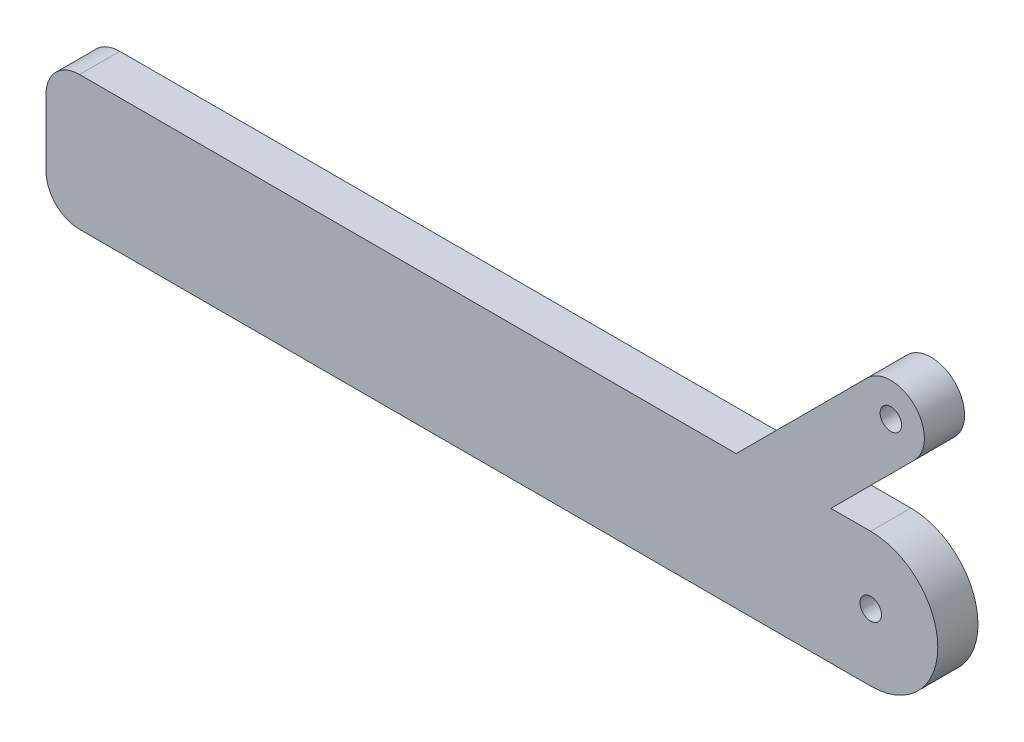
ISO-10303-21;
HEADER;
FILE_DESCRIPTION(('STEP AP214'),'2;1');
FILE_NAME('part.step','',(''),(''),'','','');
FILE_SCHEMA(('AUTOMOTIVE_DESIGN { 1 0 10303 214 1 1 1 1 }'));
ENDSEC;
DATA;
#1=APPLICATION_CONTEXT('core data for automotive mechanical design processes');
#2=APPLICATION_PROTOCOL_DEFINITION('international standard','automotive_design',2000,#1);
#3=PRODUCT_CONTEXT('',#1,'mechanical');
#4=PRODUCT('Part','Part','',(#3));
#5=PRODUCT_RELATED_PRODUCT_CATEGORY('part','',(#4));
#6=PRODUCT_DEFINITION_FORMATION('','',#4);
#7=PRODUCT_DEFINITION_CONTEXT('part definition',#1,'design');
#8=PRODUCT_DEFINITION('design','',#6,#7);
#9=PRODUCT_DEFINITION_SHAPE('','',#8);
#10=(LENGTH_UNIT() NAMED_UNIT(*) SI_UNIT(.MILLI.,.METRE.));
#11=(NAMED_UNIT(*) PLANE_ANGLE_UNIT() SI_UNIT($,.RADIAN.));
#12=(NAMED_UNIT(*) SI_UNIT($,.STERADIAN.) SOLID_ANGLE_UNIT());
#13=UNCERTAINTY_MEASURE_WITH_UNIT(LENGTH_MEASURE(1.E-05),#10,'distance_accuracy_value','');
#14=(GEOMETRIC_REPRESENTATION_CONTEXT(3) GLOBAL_UNCERTAINTY_ASSIGNED_CONTEXT((#13)) GLOBAL_UNIT_ASSIGNED_CONTEXT((#10,
#11,#12)) REPRESENTATION_CONTEXT('',''));
#15=CARTESIAN_POINT('',(0.,0.,0.));
#16=DIRECTION('',(0.,0.,1.));
#17=DIRECTION('',(1.,0.,0.));
#18=AXIS2_PLACEMENT_3D('',#15,#16,#17);
#19=CARTESIAN_POINT('',(-95.,-5.00000000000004,6.));
#20=DIRECTION('',(0.,0.,1.));
#21=DIRECTION('',(1.,0.,0.));
#22=AXIS2_PLACEMENT_3D('',#19,#20,#21);
#23=PLANE('',#22);
#24=CARTESIAN_POINT('',(23.,0.,6.));
#25=DIRECTION('',(0.,0.,1.));
#26=DIRECTION('',(1.,0.,0.));
#27=AXIS2_PLACEMENT_3D('',#24,#25,#26);
#28=CIRCLE('',#27,1.6);
#29=CARTESIAN_POINT('',(24.6,0.,6.));
#30=VERTEX_POINT('',#29);
#31=EDGE_CURVE('E150',#30,#30,#28,.T.);
#32=ORIENTED_EDGE('',*,*,#31,.F.);
#33=EDGE_LOOP('',(#32));
#34=FACE_BOUND('',#33,.T.);
#35=CARTESIAN_POINT('',(-95.,-5.00000000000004,6.));
#36=DIRECTION('',(0.,0.,1.));
#37=DIRECTION('',(1.,0.,0.));
#38=AXIS2_PLACEMENT_3D('',#35,#36,#37);
#39=CIRCLE('',#38,5.);
#40=CARTESIAN_POINT('',(-100.,-5.00000000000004,6.));
#41=VERTEX_POINT('',#40);
#42=CARTESIAN_POINT('',(-95.,-10.,6.));
#43=VERTEX_POINT('',#42);
#44=EDGE_CURVE('E165',#41,#43,#39,.T.);
#45=ORIENTED_EDGE('',*,*,#44,.T.);
#46=DIRECTION('',(1.,0.,0.));
#47=VECTOR('',#46,1.);
#48=CARTESIAN_POINT('',(-95.,-10.,6.));
#49=LINE('',#48,#47);
#50=CARTESIAN_POINT('',(23.,-9.99999999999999,6.));
#51=VERTEX_POINT('',#50);
#52=EDGE_CURVE('E103',#43,#51,#49,.T.);
#53=ORIENTED_EDGE('',*,*,#52,.T.);
#54=CARTESIAN_POINT('',(23.,0.,6.));
#55=DIRECTION('',(0.,0.,1.));
#56=DIRECTION('',(1.,0.,0.));
#57=AXIS2_PLACEMENT_3D('',#54,#55,#56);
#58=CIRCLE('',#57,9.99999999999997);
#59=CARTESIAN_POINT('',(23.,9.99999999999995,6.));
#60=VERTEX_POINT('',#59);
#61=EDGE_CURVE('E186',#51,#60,#58,.T.);
#62=ORIENTED_EDGE('',*,*,#61,.T.);
#63=DIRECTION('',(-1.,0.,0.));
#64=VECTOR('',#63,1.);
#65=CARTESIAN_POINT('',(23.,9.99999999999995,6.));
#66=LINE('',#65,#64);
#67=CARTESIAN_POINT('',(17.0710678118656,9.99999999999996,6.));
#68=VERTEX_POINT('',#67);
#69=EDGE_CURVE('E205',#60,#68,#66,.T.);
#70=ORIENTED_EDGE('',*,*,#69,.T.);
#71=DIRECTION('',(0.707106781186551,0.707106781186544,0.));
#72=VECTOR('',#71,1.);
#73=CARTESIAN_POINT('',(29.535533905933,22.4644660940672,6.));
#74=LINE('',#73,#72);
#75=CARTESIAN_POINT('',(29.535533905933,22.4644660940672,6.));
#76=VERTEX_POINT('',#75);
#77=EDGE_CURVE('E202',#68,#76,#74,.T.);
#78=ORIENTED_EDGE('',*,*,#77,.T.);
#79=CARTESIAN_POINT('',(26.0000000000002,26.,6.));
#80=DIRECTION('',(0.,0.,1.));
#81=DIRECTION('',(1.,0.,0.));
#82=AXIS2_PLACEMENT_3D('',#79,#80,#81);
#83=CIRCLE('',#82,5.);
#84=CARTESIAN_POINT('',(22.4644660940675,29.5355339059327,6.));
#85=VERTEX_POINT('',#84);
#86=EDGE_CURVE('E204',#76,#85,#83,.T.);
#87=ORIENTED_EDGE('',*,*,#86,.T.);
#88=DIRECTION('',(-0.707106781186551,-0.707106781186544,0.));
#89=VECTOR('',#88,1.);
#90=CARTESIAN_POINT('',(22.4644660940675,29.5355339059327,6.));
#91=LINE('',#90,#89);
#92=CARTESIAN_POINT('',(2.92893218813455,9.99999999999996,6.));
#93=VERTEX_POINT('',#92);
#94=EDGE_CURVE('E128',#85,#93,#91,.T.);
#95=ORIENTED_EDGE('',*,*,#94,.T.);
#96=DIRECTION('',(-1.,0.,0.));
#97=VECTOR('',#96,1.);
#98=CARTESIAN_POINT('',(2.92893218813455,9.99999999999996,6.));
#99=LINE('',#98,#97);
#100=CARTESIAN_POINT('',(-95.,9.99999999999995,6.));
#101=VERTEX_POINT('',#100);
#102=EDGE_CURVE('E122',#93,#101,#99,.T.);
#103=ORIENTED_EDGE('',*,*,#102,.T.);
#104=CARTESIAN_POINT('',(-95.,4.99999999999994,6.));
#105=DIRECTION('',(0.,0.,1.));
#106=DIRECTION('',(1.,0.,0.));
#107=AXIS2_PLACEMENT_3D('',#104,#105,#106);
#108=CIRCLE('',#107,5.);
#109=CARTESIAN_POINT('',(-100.,4.99999999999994,6.));
#110=VERTEX_POINT('',#109);
#111=EDGE_CURVE('E126',#101,#110,#108,.T.);
#112=ORIENTED_EDGE('',*,*,#111,.T.);
#113=DIRECTION('',(0.,-1.,0.));
#114=VECTOR('',#113,1.);
#115=CARTESIAN_POINT('',(-100.,4.99999999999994,6.));
#116=LINE('',#115,#114);
#117=EDGE_CURVE('E54',#110,#41,#116,.T.);
#118=ORIENTED_EDGE('',*,*,#117,.T.);
#119=EDGE_LOOP('',(#45,#53,#62,#70,#78,#87,#95,#103,#112,#118));
#120=FACE_BOUND('',#119,.T.);
#121=CARTESIAN_POINT('',(26.0000000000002,26.,6.));
#122=DIRECTION('',(0.,0.,1.));
#123=DIRECTION('',(1.,0.,0.));
#124=AXIS2_PLACEMENT_3D('',#121,#122,#123);
#125=CIRCLE('',#124,1.6);
#126=CARTESIAN_POINT('',(27.6000000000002,26.,6.));
#127=VERTEX_POINT('',#126);
#128=EDGE_CURVE('E216',#127,#127,#125,.T.);
#129=ORIENTED_EDGE('',*,*,#128,.F.);
#130=EDGE_LOOP('',(#129));
#131=FACE_BOUND('',#130,.T.);
#132=ADVANCED_FACE('F37',(#34,#120,#131),#23,.T.);
#133=CARTESIAN_POINT('',(-95.,-5.00000000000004,0.));
#134=DIRECTION('',(0.,0.,1.));
#135=DIRECTION('',(1.,0.,0.));
#136=AXIS2_PLACEMENT_3D('',#133,#134,#135);
#137=PLANE('',#136);
#138=CARTESIAN_POINT('',(23.,0.,0.));
#139=DIRECTION('',(0.,0.,1.));
#140=DIRECTION('',(1.,0.,0.));
#141=AXIS2_PLACEMENT_3D('',#138,#139,#140);
#142=CIRCLE('',#141,1.6);
#143=CARTESIAN_POINT('',(24.6,0.,0.));
#144=VERTEX_POINT('',#143);
#145=EDGE_CURVE('E213',#144,#144,#142,.T.);
#146=ORIENTED_EDGE('',*,*,#145,.T.);
#147=EDGE_LOOP('',(#146));
#148=FACE_BOUND('',#147,.T.);
#149=CARTESIAN_POINT('',(-95.,-5.00000000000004,0.));
#150=DIRECTION('',(0.,0.,1.));
#151=DIRECTION('',(1.,0.,0.));
#152=AXIS2_PLACEMENT_3D('',#149,#150,#151);
#153=CIRCLE('',#152,5.);
#154=CARTESIAN_POINT('',(-100.,-5.00000000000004,0.));
#155=VERTEX_POINT('',#154);
#156=CARTESIAN_POINT('',(-95.,-10.,0.));
#157=VERTEX_POINT('',#156);
#158=EDGE_CURVE('E146',#155,#157,#153,.T.);
#159=ORIENTED_EDGE('',*,*,#158,.F.);
#160=DIRECTION('',(0.,-1.,0.));
#161=VECTOR('',#160,1.);
#162=CARTESIAN_POINT('',(-100.,4.99999999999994,0.));
#163=LINE('',#162,#161);
#164=CARTESIAN_POINT('',(-100.,4.99999999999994,0.));
#165=VERTEX_POINT('',#164);
#166=EDGE_CURVE('E95',#165,#155,#163,.T.);
#167=ORIENTED_EDGE('',*,*,#166,.F.);
#168=CARTESIAN_POINT('',(-95.,4.99999999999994,0.));
#169=DIRECTION('',(0.,0.,1.));
#170=DIRECTION('',(1.,0.,0.));
#171=AXIS2_PLACEMENT_3D('',#168,#169,#170);
#172=CIRCLE('',#171,5.);
#173=CARTESIAN_POINT('',(-95.,9.99999999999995,0.));
#174=VERTEX_POINT('',#173);
#175=EDGE_CURVE('E89',#174,#165,#172,.T.);
#176=ORIENTED_EDGE('',*,*,#175,.F.);
#177=DIRECTION('',(-1.,0.,0.));
#178=VECTOR('',#177,1.);
#179=CARTESIAN_POINT('',(2.92893218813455,9.99999999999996,0.));
#180=LINE('',#179,#178);
#181=CARTESIAN_POINT('',(2.92893218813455,9.99999999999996,0.));
#182=VERTEX_POINT('',#181);
#183=EDGE_CURVE('E136',#182,#174,#180,.T.);
#184=ORIENTED_EDGE('',*,*,#183,.F.);
#185=DIRECTION('',(-0.707106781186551,-0.707106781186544,0.));
#186=VECTOR('',#185,1.);
#187=CARTESIAN_POINT('',(22.4644660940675,29.5355339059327,0.));
#188=LINE('',#187,#186);
#189=CARTESIAN_POINT('',(22.4644660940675,29.5355339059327,0.));
#190=VERTEX_POINT('',#189);
#191=EDGE_CURVE('E160',#190,#182,#188,.T.);
#192=ORIENTED_EDGE('',*,*,#191,.F.);
#193=CARTESIAN_POINT('',(26.0000000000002,26.,0.));
#194=DIRECTION('',(0.,0.,1.));
#195=DIRECTION('',(1.,0.,0.));
#196=AXIS2_PLACEMENT_3D('',#193,#194,#195);
#197=CIRCLE('',#196,5.);
#198=CARTESIAN_POINT('',(29.535533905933,22.4644660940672,0.));
#199=VERTEX_POINT('',#198);
#200=EDGE_CURVE('E158',#199,#190,#197,.T.);
#201=ORIENTED_EDGE('',*,*,#200,.F.);
#202=DIRECTION('',(0.707106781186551,0.707106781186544,0.));
#203=VECTOR('',#202,1.);
#204=CARTESIAN_POINT('',(29.535533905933,22.4644660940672,0.));
#205=LINE('',#204,#203);
#206=CARTESIAN_POINT('',(17.0710678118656,9.99999999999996,0.));
#207=VERTEX_POINT('',#206);
#208=EDGE_CURVE('E156',#207,#199,#205,.T.);
#209=ORIENTED_EDGE('',*,*,#208,.F.);
#210=DIRECTION('',(-1.,0.,0.));
#211=VECTOR('',#210,1.);
#212=CARTESIAN_POINT('',(23.,9.99999999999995,0.));
#213=LINE('',#212,#211);
#214=CARTESIAN_POINT('',(23.,9.99999999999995,0.));
#215=VERTEX_POINT('',#214);
#216=EDGE_CURVE('E154',#215,#207,#213,.T.);
#217=ORIENTED_EDGE('',*,*,#216,.F.);
#218=CARTESIAN_POINT('',(23.,0.,0.));
#219=DIRECTION('',(0.,0.,1.));
#220=DIRECTION('',(1.,0.,0.));
#221=AXIS2_PLACEMENT_3D('',#218,#219,#220);
#222=CIRCLE('',#221,9.99999999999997);
#223=CARTESIAN_POINT('',(23.,-9.99999999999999,0.));
#224=VERTEX_POINT('',#223);
#225=EDGE_CURVE('E152',#224,#215,#222,.T.);
#226=ORIENTED_EDGE('',*,*,#225,.F.);
#227=DIRECTION('',(1.,0.,0.));
#228=VECTOR('',#227,1.);
#229=CARTESIAN_POINT('',(-95.,-10.,0.));
#230=LINE('',#229,#228);
#231=EDGE_CURVE('E149',#157,#224,#230,.T.);
#232=ORIENTED_EDGE('',*,*,#231,.F.);
#233=EDGE_LOOP('',(#159,#167,#176,#184,#192,#201,#209,#217,#226,#232));
#234=FACE_BOUND('',#233,.T.);
#235=CARTESIAN_POINT('',(26.0000000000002,26.,0.));
#236=DIRECTION('',(0.,0.,1.));
#237=DIRECTION('',(1.,0.,0.));
#238=AXIS2_PLACEMENT_3D('',#235,#236,#237);
#239=CIRCLE('',#238,1.6);
#240=CARTESIAN_POINT('',(27.6000000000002,26.,0.));
#241=VERTEX_POINT('',#240);
#242=EDGE_CURVE('E219',#241,#241,#239,.T.);
#243=ORIENTED_EDGE('',*,*,#242,.T.);
#244=EDGE_LOOP('',(#243));
#245=FACE_BOUND('',#244,.T.);
#246=ADVANCED_FACE('F190',(#148,#234,#245),#137,.F.);
#247=CARTESIAN_POINT('',(-95.,-5.00000000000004,6.));
#248=DIRECTION('',(0.,0.,-1.));
#249=DIRECTION('',(-1.,0.,0.));
#250=AXIS2_PLACEMENT_3D('',#247,#248,#249);
#251=CYLINDRICAL_SURFACE('',#250,5.);
#252=ORIENTED_EDGE('',*,*,#158,.T.);
#253=DIRECTION('',(0.,0.,-1.));
#254=VECTOR('',#253,1.);
#255=CARTESIAN_POINT('',(-95.,-10.,6.));
#256=LINE('',#255,#254);
#257=EDGE_CURVE('E11',#43,#157,#256,.T.);
#258=ORIENTED_EDGE('',*,*,#257,.F.);
#259=ORIENTED_EDGE('',*,*,#44,.F.);
#260=DIRECTION('',(0.,0.,-1.));
#261=VECTOR('',#260,1.);
#262=CARTESIAN_POINT('',(-100.,-5.00000000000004,6.));
#263=LINE('',#262,#261);
#264=EDGE_CURVE('E142',#41,#155,#263,.T.);
#265=ORIENTED_EDGE('',*,*,#264,.T.);
#266=EDGE_LOOP('',(#252,#258,#259,#265));
#267=FACE_BOUND('',#266,.T.);
#268=ADVANCED_FACE('F39',(#267),#251,.T.);
#269=CARTESIAN_POINT('',(-95.,-10.,6.));
#270=DIRECTION('',(0.,1.,0.));
#271=DIRECTION('',(-1.,0.,0.));
#272=AXIS2_PLACEMENT_3D('',#269,#270,#271);
#273=PLANE('',#272);
#274=ORIENTED_EDGE('',*,*,#231,.T.);
#275=DIRECTION('',(0.,0.,-1.));
#276=VECTOR('',#275,1.);
#277=CARTESIAN_POINT('',(23.,-9.99999999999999,6.));
#278=LINE('',#277,#276);
#279=EDGE_CURVE('E46',#51,#224,#278,.T.);
#280=ORIENTED_EDGE('',*,*,#279,.F.);
#281=ORIENTED_EDGE('',*,*,#52,.F.);
#282=ORIENTED_EDGE('',*,*,#257,.T.);
#283=EDGE_LOOP('',(#274,#280,#281,#282));
#284=FACE_BOUND('',#283,.T.);
#285=ADVANCED_FACE('F260',(#284),#273,.F.);
#286=CARTESIAN_POINT('',(23.,0.,6.));
#287=DIRECTION('',(0.,0.,-1.));
#288=DIRECTION('',(-1.,0.,0.));
#289=AXIS2_PLACEMENT_3D('',#286,#287,#288);
#290=CYLINDRICAL_SURFACE('',#289,9.99999999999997);
#291=ORIENTED_EDGE('',*,*,#225,.T.);
#292=DIRECTION('',(0.,0.,-1.));
#293=VECTOR('',#292,1.);
#294=CARTESIAN_POINT('',(23.,9.99999999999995,6.));
#295=LINE('',#294,#293);
#296=EDGE_CURVE('E178',#60,#215,#295,.T.);
#297=ORIENTED_EDGE('',*,*,#296,.F.);
#298=ORIENTED_EDGE('',*,*,#61,.F.);
#299=ORIENTED_EDGE('',*,*,#279,.T.);
#300=EDGE_LOOP('',(#291,#297,#298,#299));
#301=FACE_BOUND('',#300,.T.);
#302=ADVANCED_FACE('F184',(#301),#290,.T.);
#303=CARTESIAN_POINT('',(23.,9.99999999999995,6.));
#304=DIRECTION('',(0.,-1.,0.));
#305=DIRECTION('',(1.,0.,0.));
#306=AXIS2_PLACEMENT_3D('',#303,#304,#305);
#307=PLANE('',#306);
#308=ORIENTED_EDGE('',*,*,#216,.T.);
#309=DIRECTION('',(0.,0.,-1.));
#310=VECTOR('',#309,1.);
#311=CARTESIAN_POINT('',(17.0710678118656,9.99999999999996,6.));
#312=LINE('',#311,#310);
#313=EDGE_CURVE('E175',#68,#207,#312,.T.);
#314=ORIENTED_EDGE('',*,*,#313,.F.);
#315=ORIENTED_EDGE('',*,*,#69,.F.);
#316=ORIENTED_EDGE('',*,*,#296,.T.);
#317=EDGE_LOOP('',(#308,#314,#315,#316));
#318=FACE_BOUND('',#317,.T.);
#319=ADVANCED_FACE('F196',(#318),#307,.F.);
#320=CARTESIAN_POINT('',(29.535533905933,22.4644660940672,6.));
#321=DIRECTION('',(-0.707106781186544,0.707106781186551,0.));
#322=DIRECTION('',(-0.707106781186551,-0.707106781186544,0.));
#323=AXIS2_PLACEMENT_3D('',#320,#321,#322);
#324=PLANE('',#323);
#325=ORIENTED_EDGE('',*,*,#208,.T.);
#326=DIRECTION('',(0.,0.,-1.));
#327=VECTOR('',#326,1.);
#328=CARTESIAN_POINT('',(29.535533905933,22.4644660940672,6.));
#329=LINE('',#328,#327);
#330=EDGE_CURVE('E172',#76,#199,#329,.T.);
#331=ORIENTED_EDGE('',*,*,#330,.F.);
#332=ORIENTED_EDGE('',*,*,#77,.F.);
#333=ORIENTED_EDGE('',*,*,#313,.T.);
#334=EDGE_LOOP('',(#325,#331,#332,#333));
#335=FACE_BOUND('',#334,.T.);
#336=ADVANCED_FACE('F200',(#335),#324,.F.);
#337=CARTESIAN_POINT('',(26.0000000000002,26.,6.));
#338=DIRECTION('',(0.,0.,-1.));
#339=DIRECTION('',(-1.,0.,0.));
#340=AXIS2_PLACEMENT_3D('',#337,#338,#339);
#341=CYLINDRICAL_SURFACE('',#340,5.);
#342=ORIENTED_EDGE('',*,*,#200,.T.);
#343=DIRECTION('',(0.,0.,-1.));
#344=VECTOR('',#343,1.);
#345=CARTESIAN_POINT('',(22.4644660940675,29.5355339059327,6.));
#346=LINE('',#345,#344);
#347=EDGE_CURVE('E169',#85,#190,#346,.T.);
#348=ORIENTED_EDGE('',*,*,#347,.F.);
#349=ORIENTED_EDGE('',*,*,#86,.F.);
#350=ORIENTED_EDGE('',*,*,#330,.T.);
#351=EDGE_LOOP('',(#342,#348,#349,#350));
#352=FACE_BOUND('',#351,.T.);
#353=ADVANCED_FACE('F250',(#352),#341,.T.);
#354=CARTESIAN_POINT('',(22.4644660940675,29.5355339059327,6.));
#355=DIRECTION('',(0.707106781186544,-0.707106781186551,0.));
#356=DIRECTION('',(0.707106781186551,0.707106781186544,0.));
#357=AXIS2_PLACEMENT_3D('',#354,#355,#356);
#358=PLANE('',#357);
#359=ORIENTED_EDGE('',*,*,#191,.T.);
#360=DIRECTION('',(0.,0.,-1.));
#361=VECTOR('',#360,1.);
#362=CARTESIAN_POINT('',(2.92893218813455,9.99999999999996,6.));
#363=LINE('',#362,#361);
#364=EDGE_CURVE('E137',#93,#182,#363,.T.);
#365=ORIENTED_EDGE('',*,*,#364,.F.);
#366=ORIENTED_EDGE('',*,*,#94,.F.);
#367=ORIENTED_EDGE('',*,*,#347,.T.);
#368=EDGE_LOOP('',(#359,#365,#366,#367));
#369=FACE_BOUND('',#368,.T.);
#370=ADVANCED_FACE('F247',(#369),#358,.F.);
#371=CARTESIAN_POINT('',(2.92893218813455,9.99999999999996,6.));
#372=DIRECTION('',(0.,-1.,0.));
#373=DIRECTION('',(1.,0.,0.));
#374=AXIS2_PLACEMENT_3D('',#371,#372,#373);
#375=PLANE('',#374);
#376=ORIENTED_EDGE('',*,*,#183,.T.);
#377=DIRECTION('',(0.,0.,-1.));
#378=VECTOR('',#377,1.);
#379=CARTESIAN_POINT('',(-95.,9.99999999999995,6.));
#380=LINE('',#379,#378);
#381=EDGE_CURVE('E133',#101,#174,#380,.T.);
#382=ORIENTED_EDGE('',*,*,#381,.F.);
#383=ORIENTED_EDGE('',*,*,#102,.F.);
#384=ORIENTED_EDGE('',*,*,#364,.T.);
#385=EDGE_LOOP('',(#376,#382,#383,#384));
#386=FACE_BOUND('',#385,.T.);
#387=ADVANCED_FACE('F134',(#386),#375,.F.);
#388=CARTESIAN_POINT('',(-95.,4.99999999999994,6.));
#389=DIRECTION('',(0.,0.,-1.));
#390=DIRECTION('',(-1.,0.,0.));
#391=AXIS2_PLACEMENT_3D('',#388,#389,#390);
#392=CYLINDRICAL_SURFACE('',#391,5.);
#393=ORIENTED_EDGE('',*,*,#175,.T.);
#394=DIRECTION('',(0.,0.,-1.));
#395=VECTOR('',#394,1.);
#396=CARTESIAN_POINT('',(-100.,4.99999999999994,6.));
#397=LINE('',#396,#395);
#398=EDGE_CURVE('E138',#110,#165,#397,.T.);
#399=ORIENTED_EDGE('',*,*,#398,.F.);
#400=ORIENTED_EDGE('',*,*,#111,.F.);
#401=ORIENTED_EDGE('',*,*,#381,.T.);
#402=EDGE_LOOP('',(#393,#399,#400,#401));
#403=FACE_BOUND('',#402,.T.);
#404=ADVANCED_FACE('F140',(#403),#392,.T.);
#405=CARTESIAN_POINT('',(-100.,4.99999999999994,6.));
#406=DIRECTION('',(1.,0.,0.));
#407=DIRECTION('',(0.,0.,-1.));
#408=AXIS2_PLACEMENT_3D('',#405,#406,#407);
#409=PLANE('',#408);
#410=ORIENTED_EDGE('',*,*,#166,.T.);
#411=ORIENTED_EDGE('',*,*,#264,.F.);
#412=ORIENTED_EDGE('',*,*,#117,.F.);
#413=ORIENTED_EDGE('',*,*,#398,.T.);
#414=EDGE_LOOP('',(#410,#411,#412,#413));
#415=FACE_BOUND('',#414,.T.);
#416=ADVANCED_FACE('F240',(#415),#409,.F.);
#417=CARTESIAN_POINT('',(23.,0.,6.));
#418=DIRECTION('',(0.,0.,-1.));
#419=DIRECTION('',(-1.,0.,0.));
#420=AXIS2_PLACEMENT_3D('',#417,#418,#419);
#421=CYLINDRICAL_SURFACE('',#420,1.6);
#422=ORIENTED_EDGE('',*,*,#31,.T.);
#423=EDGE_LOOP('',(#422));
#424=FACE_BOUND('',#423,.T.);
#425=ORIENTED_EDGE('',*,*,#145,.F.);
#426=EDGE_LOOP('',(#425));
#427=FACE_BOUND('',#426,.T.);
#428=ADVANCED_FACE('F237',(#424,#427),#421,.F.);
#429=CARTESIAN_POINT('',(26.0000000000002,26.,6.));
#430=DIRECTION('',(0.,0.,-1.));
#431=DIRECTION('',(-1.,0.,0.));
#432=AXIS2_PLACEMENT_3D('',#429,#430,#431);
#433=CYLINDRICAL_SURFACE('',#432,1.6);
#434=ORIENTED_EDGE('',*,*,#128,.T.);
#435=EDGE_LOOP('',(#434));
#436=FACE_BOUND('',#435,.T.);
#437=ORIENTED_EDGE('',*,*,#242,.F.);
#438=EDGE_LOOP('',(#437));
#439=FACE_BOUND('',#438,.T.);
#440=ADVANCED_FACE('F225',(#436,#439),#433,.F.);
#441=CLOSED_SHELL('',(#132,#246,#268,#285,#302,#319,#336,#353,#370,#387,#404,#416,#428,#440));
#442=MANIFOLD_SOLID_BREP('B2',#441);
#443=ADVANCED_BREP_SHAPE_REPRESENTATION('',(#18,#442),#14);
#444=SHAPE_DEFINITION_REPRESENTATION(#9,#443);
ENDSEC;
END-ISO-10303-21;
